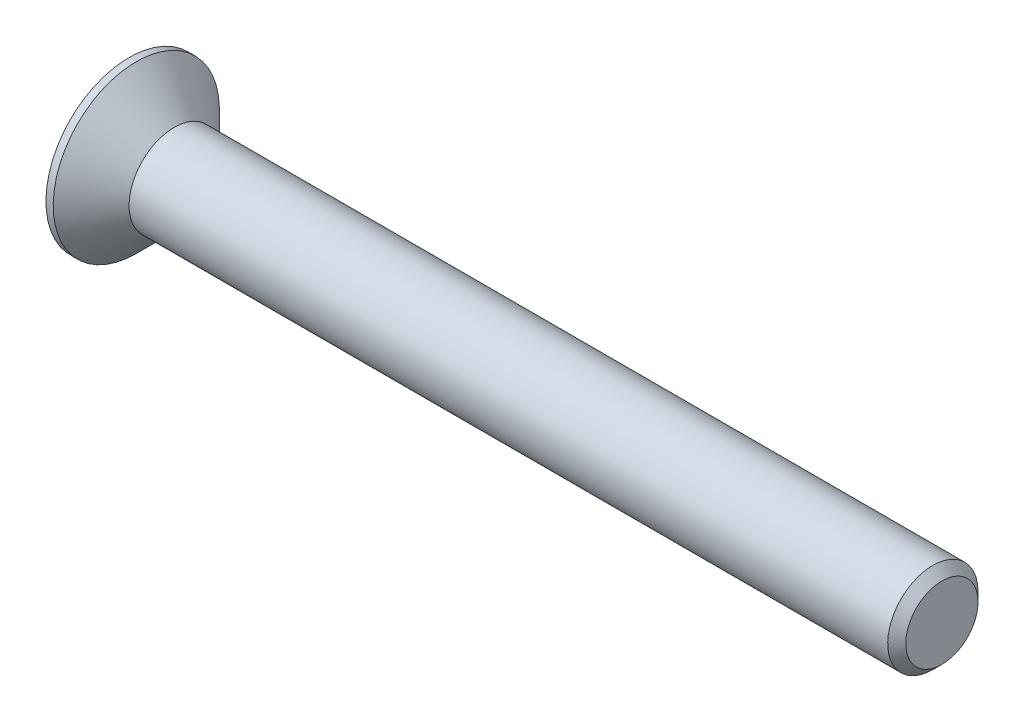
ISO-10303-21;
HEADER;
FILE_DESCRIPTION(('STEP AP214'),'2;1');
FILE_NAME('part.step','',(''),(''),'','','');
FILE_SCHEMA(('AUTOMOTIVE_DESIGN { 1 0 10303 214 1 1 1 1 }'));
ENDSEC;
DATA;
#1=APPLICATION_CONTEXT('core data for automotive mechanical design processes');
#2=APPLICATION_PROTOCOL_DEFINITION('international standard','automotive_design',2000,#1);
#3=PRODUCT_CONTEXT('',#1,'mechanical');
#4=PRODUCT('Part','Part','',(#3));
#5=PRODUCT_RELATED_PRODUCT_CATEGORY('part','',(#4));
#6=PRODUCT_DEFINITION_FORMATION('','',#4);
#7=PRODUCT_DEFINITION_CONTEXT('part definition',#1,'design');
#8=PRODUCT_DEFINITION('design','',#6,#7);
#9=PRODUCT_DEFINITION_SHAPE('','',#8);
#10=(LENGTH_UNIT() NAMED_UNIT(*) SI_UNIT(.MILLI.,.METRE.));
#11=(NAMED_UNIT(*) PLANE_ANGLE_UNIT() SI_UNIT($,.RADIAN.));
#12=(NAMED_UNIT(*) SI_UNIT($,.STERADIAN.) SOLID_ANGLE_UNIT());
#13=UNCERTAINTY_MEASURE_WITH_UNIT(LENGTH_MEASURE(1.E-05),#10,'distance_accuracy_value','');
#14=(GEOMETRIC_REPRESENTATION_CONTEXT(3) GLOBAL_UNCERTAINTY_ASSIGNED_CONTEXT((#13)) GLOBAL_UNIT_ASSIGNED_CONTEXT((#10,
#11,#12)) REPRESENTATION_CONTEXT('',''));
#15=CARTESIAN_POINT('',(0.,0.,0.));
#16=DIRECTION('',(0.,0.,1.));
#17=DIRECTION('',(1.,0.,0.));
#18=AXIS2_PLACEMENT_3D('',#15,#16,#17);
#19=CARTESIAN_POINT('',(0.,0.,0.));
#20=DIRECTION('',(-1.,0.,0.));
#21=DIRECTION('',(0.,-1.,0.));
#22=AXIS2_PLACEMENT_3D('',#19,#20,#21);
#23=CONICAL_SURFACE('',#22,2.5,0.78539816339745);
#24=CARTESIAN_POINT('',(-2.09999999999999,0.,0.));
#25=DIRECTION('',(-1.,0.,0.));
#26=DIRECTION('',(0.,-1.,0.));
#27=AXIS2_PLACEMENT_3D('',#24,#25,#26);
#28=CIRCLE('',#27,4.6);
#29=CARTESIAN_POINT('',(-2.09999999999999,-4.6,0.));
#30=VERTEX_POINT('',#29);
#31=EDGE_CURVE('E189',#30,#30,#28,.T.);
#32=ORIENTED_EDGE('',*,*,#31,.F.);
#33=EDGE_LOOP('',(#32));
#34=FACE_BOUND('',#33,.T.);
#35=CARTESIAN_POINT('',(0.,0.,0.));
#36=DIRECTION('',(-1.,0.,0.));
#37=DIRECTION('',(0.,-1.,0.));
#38=AXIS2_PLACEMENT_3D('',#35,#36,#37);
#39=CIRCLE('',#38,2.5);
#40=CARTESIAN_POINT('',(0.,-2.5,0.));
#41=VERTEX_POINT('',#40);
#42=EDGE_CURVE('E212',#41,#41,#39,.T.);
#43=ORIENTED_EDGE('',*,*,#42,.T.);
#44=EDGE_LOOP('',(#43));
#45=FACE_BOUND('',#44,.T.);
#46=ADVANCED_FACE('F33',(#34,#45),#23,.T.);
#47=CARTESIAN_POINT('',(-2.5,0.,0.));
#48=DIRECTION('',(-1.,0.,0.));
#49=DIRECTION('',(0.,-1.,0.));
#50=AXIS2_PLACEMENT_3D('',#47,#48,#49);
#51=CYLINDRICAL_SURFACE('',#50,2.5);
#52=CARTESIAN_POINT('',(42.,0.,0.));
#53=DIRECTION('',(-1.,0.,0.));
#54=DIRECTION('',(0.,-1.,0.));
#55=AXIS2_PLACEMENT_3D('',#52,#53,#54);
#56=CIRCLE('',#55,2.5);
#57=CARTESIAN_POINT('',(42.,-2.5,0.));
#58=VERTEX_POINT('',#57);
#59=EDGE_CURVE('E41',#58,#58,#56,.T.);
#60=ORIENTED_EDGE('',*,*,#59,.T.);
#61=EDGE_LOOP('',(#60));
#62=FACE_BOUND('',#61,.T.);
#63=ORIENTED_EDGE('',*,*,#42,.F.);
#64=EDGE_LOOP('',(#63));
#65=FACE_BOUND('',#64,.T.);
#66=ADVANCED_FACE('F217',(#62,#65),#51,.T.);
#67=CARTESIAN_POINT('',(42.5,0.,0.));
#68=DIRECTION('',(-1.,0.,0.));
#69=DIRECTION('',(0.,-1.,0.));
#70=AXIS2_PLACEMENT_3D('',#67,#68,#69);
#71=PLANE('',#70);
#72=CARTESIAN_POINT('',(42.5,0.,0.));
#73=DIRECTION('',(-1.,0.,0.));
#74=DIRECTION('',(0.,-1.,0.));
#75=AXIS2_PLACEMENT_3D('',#72,#73,#74);
#76=CIRCLE('',#75,2.00000000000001);
#77=CARTESIAN_POINT('',(42.5,-2.00000000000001,0.));
#78=VERTEX_POINT('',#77);
#79=EDGE_CURVE('E11',#78,#78,#76,.F.);
#80=ORIENTED_EDGE('',*,*,#79,.T.);
#81=EDGE_LOOP('',(#80));
#82=FACE_BOUND('',#81,.T.);
#83=ADVANCED_FACE('F239',(#82),#71,.F.);
#84=CARTESIAN_POINT('',(-2.5,4.6,0.));
#85=DIRECTION('',(1.,0.,0.));
#86=DIRECTION('',(0.,1.,0.));
#87=AXIS2_PLACEMENT_3D('',#84,#85,#86);
#88=PLANE('',#87);
#89=DIRECTION('',(0.,0.,-1.));
#90=VECTOR('',#89,1.);
#91=CARTESIAN_POINT('',(-2.5,0.575,-2.3));
#92=LINE('',#91,#90);
#93=CARTESIAN_POINT('',(-2.5,0.575,-0.575));
#94=VERTEX_POINT('',#93);
#95=CARTESIAN_POINT('',(-2.5,0.575,-2.3));
#96=VERTEX_POINT('',#95);
#97=EDGE_CURVE('E158',#94,#96,#92,.T.);
#98=ORIENTED_EDGE('',*,*,#97,.F.);
#99=DIRECTION('',(0.,-1.,0.));
#100=VECTOR('',#99,1.);
#101=CARTESIAN_POINT('',(-2.5,0.575,-0.575));
#102=LINE('',#101,#100);
#103=CARTESIAN_POINT('',(-2.5,2.3,-0.575));
#104=VERTEX_POINT('',#103);
#105=EDGE_CURVE('E48',#104,#94,#102,.T.);
#106=ORIENTED_EDGE('',*,*,#105,.F.);
#107=DIRECTION('',(0.,0.,-1.));
#108=VECTOR('',#107,1.);
#109=CARTESIAN_POINT('',(-2.5,2.3,-0.575));
#110=LINE('',#109,#108);
#111=CARTESIAN_POINT('',(-2.5,2.3,0.575));
#112=VERTEX_POINT('',#111);
#113=EDGE_CURVE('E185',#112,#104,#110,.T.);
#114=ORIENTED_EDGE('',*,*,#113,.F.);
#115=DIRECTION('',(0.,1.,0.));
#116=VECTOR('',#115,1.);
#117=CARTESIAN_POINT('',(-2.5,2.3,0.575));
#118=LINE('',#117,#116);
#119=CARTESIAN_POINT('',(-2.5,0.575,0.575));
#120=VERTEX_POINT('',#119);
#121=EDGE_CURVE('E183',#120,#112,#118,.T.);
#122=ORIENTED_EDGE('',*,*,#121,.F.);
#123=DIRECTION('',(0.,0.,-1.));
#124=VECTOR('',#123,1.);
#125=CARTESIAN_POINT('',(-2.5,0.575,0.575));
#126=LINE('',#125,#124);
#127=CARTESIAN_POINT('',(-2.5,0.575,2.3));
#128=VERTEX_POINT('',#127);
#129=EDGE_CURVE('E132',#128,#120,#126,.T.);
#130=ORIENTED_EDGE('',*,*,#129,.F.);
#131=DIRECTION('',(0.,1.,0.));
#132=VECTOR('',#131,1.);
#133=CARTESIAN_POINT('',(-2.5,0.575,2.3));
#134=LINE('',#133,#132);
#135=CARTESIAN_POINT('',(-2.5,-0.575,2.3));
#136=VERTEX_POINT('',#135);
#137=EDGE_CURVE('E179',#136,#128,#134,.T.);
#138=ORIENTED_EDGE('',*,*,#137,.F.);
#139=DIRECTION('',(0.,0.,1.));
#140=VECTOR('',#139,1.);
#141=CARTESIAN_POINT('',(-2.5,-0.575,2.3));
#142=LINE('',#141,#140);
#143=CARTESIAN_POINT('',(-2.5,-0.575,0.575));
#144=VERTEX_POINT('',#143);
#145=EDGE_CURVE('E176',#144,#136,#142,.T.);
#146=ORIENTED_EDGE('',*,*,#145,.F.);
#147=DIRECTION('',(0.,1.,0.));
#148=VECTOR('',#147,1.);
#149=CARTESIAN_POINT('',(-2.5,-0.575,0.575));
#150=LINE('',#149,#148);
#151=CARTESIAN_POINT('',(-2.5,-2.3,0.575));
#152=VERTEX_POINT('',#151);
#153=EDGE_CURVE('E173',#152,#144,#150,.T.);
#154=ORIENTED_EDGE('',*,*,#153,.F.);
#155=DIRECTION('',(0.,0.,1.));
#156=VECTOR('',#155,1.);
#157=CARTESIAN_POINT('',(-2.5,-2.3,0.575));
#158=LINE('',#157,#156);
#159=CARTESIAN_POINT('',(-2.5,-2.3,-0.575));
#160=VERTEX_POINT('',#159);
#161=EDGE_CURVE('E170',#160,#152,#158,.T.);
#162=ORIENTED_EDGE('',*,*,#161,.F.);
#163=DIRECTION('',(0.,-1.,0.));
#164=VECTOR('',#163,1.);
#165=CARTESIAN_POINT('',(-2.5,-2.3,-0.575));
#166=LINE('',#165,#164);
#167=CARTESIAN_POINT('',(-2.5,-0.575,-0.575));
#168=VERTEX_POINT('',#167);
#169=EDGE_CURVE('E167',#168,#160,#166,.T.);
#170=ORIENTED_EDGE('',*,*,#169,.F.);
#171=DIRECTION('',(0.,0.,1.));
#172=VECTOR('',#171,1.);
#173=CARTESIAN_POINT('',(-2.5,-0.575,-0.575));
#174=LINE('',#173,#172);
#175=CARTESIAN_POINT('',(-2.5,-0.575,-2.3));
#176=VERTEX_POINT('',#175);
#177=EDGE_CURVE('E164',#176,#168,#174,.T.);
#178=ORIENTED_EDGE('',*,*,#177,.F.);
#179=DIRECTION('',(0.,-1.,0.));
#180=VECTOR('',#179,1.);
#181=CARTESIAN_POINT('',(-2.5,-0.575,-2.3));
#182=LINE('',#181,#180);
#183=EDGE_CURVE('E161',#96,#176,#182,.T.);
#184=ORIENTED_EDGE('',*,*,#183,.F.);
#185=EDGE_LOOP('',(#98,#106,#114,#122,#130,#138,#146,#154,#162,#170,#178,#184));
#186=FACE_BOUND('',#185,.T.);
#187=CARTESIAN_POINT('',(-2.5,0.,0.));
#188=DIRECTION('',(-1.,0.,0.));
#189=DIRECTION('',(0.,-1.,0.));
#190=AXIS2_PLACEMENT_3D('',#187,#188,#189);
#191=CIRCLE('',#190,4.6);
#192=CARTESIAN_POINT('',(-2.5,-4.6,0.));
#193=VERTEX_POINT('',#192);
#194=EDGE_CURVE('E209',#193,#193,#191,.T.);
#195=ORIENTED_EDGE('',*,*,#194,.T.);
#196=EDGE_LOOP('',(#195));
#197=FACE_BOUND('',#196,.T.);
#198=ADVANCED_FACE('F230',(#186,#197),#88,.F.);
#199=CARTESIAN_POINT('',(-2.5,0.,0.));
#200=DIRECTION('',(-1.,0.,0.));
#201=DIRECTION('',(0.,-1.,0.));
#202=AXIS2_PLACEMENT_3D('',#199,#200,#201);
#203=CYLINDRICAL_SURFACE('',#202,4.6);
#204=ORIENTED_EDGE('',*,*,#194,.F.);
#205=EDGE_LOOP('',(#204));
#206=FACE_BOUND('',#205,.T.);
#207=ORIENTED_EDGE('',*,*,#31,.T.);
#208=EDGE_LOOP('',(#207));
#209=FACE_BOUND('',#208,.T.);
#210=ADVANCED_FACE('F222',(#206,#209),#203,.T.);
#211=CARTESIAN_POINT('',(42.,0.,0.));
#212=DIRECTION('',(-1.,0.,0.));
#213=DIRECTION('',(0.,-1.,0.));
#214=AXIS2_PLACEMENT_3D('',#211,#212,#213);
#215=CONICAL_SURFACE('',#214,2.5,0.785398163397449);
#216=ORIENTED_EDGE('',*,*,#79,.F.);
#217=EDGE_LOOP('',(#216));
#218=FACE_BOUND('',#217,.T.);
#219=ORIENTED_EDGE('',*,*,#59,.F.);
#220=EDGE_LOOP('',(#219));
#221=FACE_BOUND('',#220,.T.);
#222=ADVANCED_FACE('F35',(#218,#221),#215,.T.);
#223=CARTESIAN_POINT('',(-0.4,0.575,-0.575));
#224=DIRECTION('',(0.,0.,-1.));
#225=DIRECTION('',(-1.,0.,0.));
#226=AXIS2_PLACEMENT_3D('',#223,#224,#225);
#227=PLANE('',#226);
#228=ORIENTED_EDGE('',*,*,#105,.T.);
#229=DIRECTION('',(-1.,0.,0.));
#230=VECTOR('',#229,1.);
#231=CARTESIAN_POINT('',(-0.4,0.575,-0.575));
#232=LINE('',#231,#230);
#233=CARTESIAN_POINT('',(-0.4,0.575,-0.575));
#234=VERTEX_POINT('',#233);
#235=EDGE_CURVE('E96',#234,#94,#232,.T.);
#236=ORIENTED_EDGE('',*,*,#235,.F.);
#237=DIRECTION('',(0.,-1.,0.));
#238=VECTOR('',#237,1.);
#239=CARTESIAN_POINT('',(-0.4,0.575,-0.575));
#240=LINE('',#239,#238);
#241=CARTESIAN_POINT('',(-0.4,2.3,-0.575));
#242=VERTEX_POINT('',#241);
#243=EDGE_CURVE('E187',#242,#234,#240,.T.);
#244=ORIENTED_EDGE('',*,*,#243,.F.);
#245=DIRECTION('',(-1.,0.,0.));
#246=VECTOR('',#245,1.);
#247=CARTESIAN_POINT('',(-0.4,2.3,-0.575));
#248=LINE('',#247,#246);
#249=EDGE_CURVE('E56',#242,#104,#248,.T.);
#250=ORIENTED_EDGE('',*,*,#249,.T.);
#251=EDGE_LOOP('',(#228,#236,#244,#250));
#252=FACE_BOUND('',#251,.T.);
#253=ADVANCED_FACE('F221',(#252),#227,.F.);
#254=CARTESIAN_POINT('',(-0.4,2.3,-0.575));
#255=DIRECTION('',(0.,1.,0.));
#256=DIRECTION('',(-1.,0.,0.));
#257=AXIS2_PLACEMENT_3D('',#254,#255,#256);
#258=PLANE('',#257);
#259=ORIENTED_EDGE('',*,*,#113,.T.);
#260=ORIENTED_EDGE('',*,*,#249,.F.);
#261=DIRECTION('',(0.,0.,-1.));
#262=VECTOR('',#261,1.);
#263=CARTESIAN_POINT('',(-0.4,2.3,-0.575));
#264=LINE('',#263,#262);
#265=CARTESIAN_POINT('',(-0.4,2.3,0.575));
#266=VERTEX_POINT('',#265);
#267=EDGE_CURVE('E144',#266,#242,#264,.T.);
#268=ORIENTED_EDGE('',*,*,#267,.F.);
#269=DIRECTION('',(-1.,0.,0.));
#270=VECTOR('',#269,1.);
#271=CARTESIAN_POINT('',(-0.4,2.3,0.575));
#272=LINE('',#271,#270);
#273=EDGE_CURVE('E136',#266,#112,#272,.T.);
#274=ORIENTED_EDGE('',*,*,#273,.T.);
#275=EDGE_LOOP('',(#259,#260,#268,#274));
#276=FACE_BOUND('',#275,.T.);
#277=ADVANCED_FACE('F228',(#276),#258,.F.);
#278=CARTESIAN_POINT('',(-0.4,2.3,0.575));
#279=DIRECTION('',(0.,0.,1.));
#280=DIRECTION('',(1.,0.,0.));
#281=AXIS2_PLACEMENT_3D('',#278,#279,#280);
#282=PLANE('',#281);
#283=ORIENTED_EDGE('',*,*,#121,.T.);
#284=ORIENTED_EDGE('',*,*,#273,.F.);
#285=DIRECTION('',(0.,1.,0.));
#286=VECTOR('',#285,1.);
#287=CARTESIAN_POINT('',(-0.4,2.3,0.575));
#288=LINE('',#287,#286);
#289=CARTESIAN_POINT('',(-0.4,0.575,0.575));
#290=VERTEX_POINT('',#289);
#291=EDGE_CURVE('E140',#290,#266,#288,.T.);
#292=ORIENTED_EDGE('',*,*,#291,.F.);
#293=DIRECTION('',(-1.,0.,0.));
#294=VECTOR('',#293,1.);
#295=CARTESIAN_POINT('',(-0.4,0.575,0.575));
#296=LINE('',#295,#294);
#297=EDGE_CURVE('E125',#290,#120,#296,.T.);
#298=ORIENTED_EDGE('',*,*,#297,.T.);
#299=EDGE_LOOP('',(#283,#284,#292,#298));
#300=FACE_BOUND('',#299,.T.);
#301=ADVANCED_FACE('F141',(#300),#282,.F.);
#302=CARTESIAN_POINT('',(-0.4,0.575,0.575));
#303=DIRECTION('',(0.,1.,0.));
#304=DIRECTION('',(-1.,0.,0.));
#305=AXIS2_PLACEMENT_3D('',#302,#303,#304);
#306=PLANE('',#305);
#307=ORIENTED_EDGE('',*,*,#129,.T.);
#308=ORIENTED_EDGE('',*,*,#297,.F.);
#309=DIRECTION('',(0.,0.,-1.));
#310=VECTOR('',#309,1.);
#311=CARTESIAN_POINT('',(-0.4,0.575,0.575));
#312=LINE('',#311,#310);
#313=CARTESIAN_POINT('',(-0.4,0.575,2.3));
#314=VERTEX_POINT('',#313);
#315=EDGE_CURVE('E129',#314,#290,#312,.T.);
#316=ORIENTED_EDGE('',*,*,#315,.F.);
#317=DIRECTION('',(-1.,0.,0.));
#318=VECTOR('',#317,1.);
#319=CARTESIAN_POINT('',(-0.4,0.575,2.3));
#320=LINE('',#319,#318);
#321=EDGE_CURVE('E137',#314,#128,#320,.T.);
#322=ORIENTED_EDGE('',*,*,#321,.T.);
#323=EDGE_LOOP('',(#307,#308,#316,#322));
#324=FACE_BOUND('',#323,.T.);
#325=ADVANCED_FACE('F127',(#324),#306,.F.);
#326=CARTESIAN_POINT('',(-0.4,0.575,2.3));
#327=DIRECTION('',(0.,0.,1.));
#328=DIRECTION('',(1.,0.,0.));
#329=AXIS2_PLACEMENT_3D('',#326,#327,#328);
#330=PLANE('',#329);
#331=ORIENTED_EDGE('',*,*,#137,.T.);
#332=ORIENTED_EDGE('',*,*,#321,.F.);
#333=DIRECTION('',(0.,1.,0.));
#334=VECTOR('',#333,1.);
#335=CARTESIAN_POINT('',(-0.4,0.575,2.3));
#336=LINE('',#335,#334);
#337=CARTESIAN_POINT('',(-0.4,-0.575,2.3));
#338=VERTEX_POINT('',#337);
#339=EDGE_CURVE('E150',#338,#314,#336,.T.);
#340=ORIENTED_EDGE('',*,*,#339,.F.);
#341=DIRECTION('',(-1.,0.,0.));
#342=VECTOR('',#341,1.);
#343=CARTESIAN_POINT('',(-0.4,-0.575,2.3));
#344=LINE('',#343,#342);
#345=EDGE_CURVE('E192',#338,#136,#344,.T.);
#346=ORIENTED_EDGE('',*,*,#345,.T.);
#347=EDGE_LOOP('',(#331,#332,#340,#346));
#348=FACE_BOUND('',#347,.T.);
#349=ADVANCED_FACE('F277',(#348),#330,.F.);
#350=CARTESIAN_POINT('',(-0.4,-0.575,2.3));
#351=DIRECTION('',(0.,-1.,0.));
#352=DIRECTION('',(1.,0.,0.));
#353=AXIS2_PLACEMENT_3D('',#350,#351,#352);
#354=PLANE('',#353);
#355=ORIENTED_EDGE('',*,*,#145,.T.);
#356=ORIENTED_EDGE('',*,*,#345,.F.);
#357=DIRECTION('',(0.,0.,1.));
#358=VECTOR('',#357,1.);
#359=CARTESIAN_POINT('',(-0.4,-0.575,2.3));
#360=LINE('',#359,#358);
#361=CARTESIAN_POINT('',(-0.4,-0.575,0.575));
#362=VERTEX_POINT('',#361);
#363=EDGE_CURVE('E152',#362,#338,#360,.T.);
#364=ORIENTED_EDGE('',*,*,#363,.F.);
#365=DIRECTION('',(-1.,0.,0.));
#366=VECTOR('',#365,1.);
#367=CARTESIAN_POINT('',(-0.4,-0.575,0.575));
#368=LINE('',#367,#366);
#369=EDGE_CURVE('E194',#362,#144,#368,.T.);
#370=ORIENTED_EDGE('',*,*,#369,.T.);
#371=EDGE_LOOP('',(#355,#356,#364,#370));
#372=FACE_BOUND('',#371,.T.);
#373=ADVANCED_FACE('F273',(#372),#354,.F.);
#374=CARTESIAN_POINT('',(-0.4,-0.575,0.575));
#375=DIRECTION('',(0.,0.,1.));
#376=DIRECTION('',(1.,0.,0.));
#377=AXIS2_PLACEMENT_3D('',#374,#375,#376);
#378=PLANE('',#377);
#379=ORIENTED_EDGE('',*,*,#153,.T.);
#380=ORIENTED_EDGE('',*,*,#369,.F.);
#381=DIRECTION('',(0.,1.,0.));
#382=VECTOR('',#381,1.);
#383=CARTESIAN_POINT('',(-0.4,-0.575,0.575));
#384=LINE('',#383,#382);
#385=CARTESIAN_POINT('',(-0.4,-2.3,0.575));
#386=VERTEX_POINT('',#385);
#387=EDGE_CURVE('E422',#386,#362,#384,.T.);
#388=ORIENTED_EDGE('',*,*,#387,.F.);
#389=DIRECTION('',(-1.,0.,0.));
#390=VECTOR('',#389,1.);
#391=CARTESIAN_POINT('',(-0.4,-2.3,0.575));
#392=LINE('',#391,#390);
#393=EDGE_CURVE('E196',#386,#152,#392,.T.);
#394=ORIENTED_EDGE('',*,*,#393,.T.);
#395=EDGE_LOOP('',(#379,#380,#388,#394));
#396=FACE_BOUND('',#395,.T.);
#397=ADVANCED_FACE('F269',(#396),#378,.F.);
#398=CARTESIAN_POINT('',(-0.4,-2.3,0.575));
#399=DIRECTION('',(0.,-1.,0.));
#400=DIRECTION('',(1.,0.,0.));
#401=AXIS2_PLACEMENT_3D('',#398,#399,#400);
#402=PLANE('',#401);
#403=ORIENTED_EDGE('',*,*,#161,.T.);
#404=ORIENTED_EDGE('',*,*,#393,.F.);
#405=DIRECTION('',(0.,0.,1.));
#406=VECTOR('',#405,1.);
#407=CARTESIAN_POINT('',(-0.4,-2.3,0.575));
#408=LINE('',#407,#406);
#409=CARTESIAN_POINT('',(-0.4,-2.3,-0.575));
#410=VERTEX_POINT('',#409);
#411=EDGE_CURVE('E419',#410,#386,#408,.T.);
#412=ORIENTED_EDGE('',*,*,#411,.F.);
#413=DIRECTION('',(-1.,0.,0.));
#414=VECTOR('',#413,1.);
#415=CARTESIAN_POINT('',(-0.4,-2.3,-0.575));
#416=LINE('',#415,#414);
#417=EDGE_CURVE('E198',#410,#160,#416,.T.);
#418=ORIENTED_EDGE('',*,*,#417,.T.);
#419=EDGE_LOOP('',(#403,#404,#412,#418));
#420=FACE_BOUND('',#419,.T.);
#421=ADVANCED_FACE('F265',(#420),#402,.F.);
#422=CARTESIAN_POINT('',(-0.4,-2.3,-0.575));
#423=DIRECTION('',(0.,0.,-1.));
#424=DIRECTION('',(-1.,0.,0.));
#425=AXIS2_PLACEMENT_3D('',#422,#423,#424);
#426=PLANE('',#425);
#427=ORIENTED_EDGE('',*,*,#169,.T.);
#428=ORIENTED_EDGE('',*,*,#417,.F.);
#429=DIRECTION('',(0.,-1.,0.));
#430=VECTOR('',#429,1.);
#431=CARTESIAN_POINT('',(-0.4,-2.3,-0.575));
#432=LINE('',#431,#430);
#433=CARTESIAN_POINT('',(-0.4,-0.575,-0.575));
#434=VERTEX_POINT('',#433);
#435=EDGE_CURVE('E416',#434,#410,#432,.T.);
#436=ORIENTED_EDGE('',*,*,#435,.F.);
#437=DIRECTION('',(-1.,0.,0.));
#438=VECTOR('',#437,1.);
#439=CARTESIAN_POINT('',(-0.4,-0.575,-0.575));
#440=LINE('',#439,#438);
#441=EDGE_CURVE('E200',#434,#168,#440,.T.);
#442=ORIENTED_EDGE('',*,*,#441,.T.);
#443=EDGE_LOOP('',(#427,#428,#436,#442));
#444=FACE_BOUND('',#443,.T.);
#445=ADVANCED_FACE('F261',(#444),#426,.F.);
#446=CARTESIAN_POINT('',(-0.4,-0.575,-0.575));
#447=DIRECTION('',(0.,-1.,0.));
#448=DIRECTION('',(1.,0.,0.));
#449=AXIS2_PLACEMENT_3D('',#446,#447,#448);
#450=PLANE('',#449);
#451=ORIENTED_EDGE('',*,*,#177,.T.);
#452=ORIENTED_EDGE('',*,*,#441,.F.);
#453=DIRECTION('',(0.,0.,1.));
#454=VECTOR('',#453,1.);
#455=CARTESIAN_POINT('',(-0.4,-0.575,-0.575));
#456=LINE('',#455,#454);
#457=CARTESIAN_POINT('',(-0.4,-0.575,-2.3));
#458=VERTEX_POINT('',#457);
#459=EDGE_CURVE('E413',#458,#434,#456,.T.);
#460=ORIENTED_EDGE('',*,*,#459,.F.);
#461=DIRECTION('',(-1.,0.,0.));
#462=VECTOR('',#461,1.);
#463=CARTESIAN_POINT('',(-0.4,-0.575,-2.3));
#464=LINE('',#463,#462);
#465=EDGE_CURVE('E202',#458,#176,#464,.T.);
#466=ORIENTED_EDGE('',*,*,#465,.T.);
#467=EDGE_LOOP('',(#451,#452,#460,#466));
#468=FACE_BOUND('',#467,.T.);
#469=ADVANCED_FACE('F257',(#468),#450,.F.);
#470=CARTESIAN_POINT('',(-0.4,-0.575,-2.3));
#471=DIRECTION('',(0.,0.,-1.));
#472=DIRECTION('',(-1.,0.,0.));
#473=AXIS2_PLACEMENT_3D('',#470,#471,#472);
#474=PLANE('',#473);
#475=ORIENTED_EDGE('',*,*,#183,.T.);
#476=ORIENTED_EDGE('',*,*,#465,.F.);
#477=DIRECTION('',(0.,-1.,0.));
#478=VECTOR('',#477,1.);
#479=CARTESIAN_POINT('',(-0.4,-0.575,-2.3));
#480=LINE('',#479,#478);
#481=CARTESIAN_POINT('',(-0.4,0.575,-2.3));
#482=VERTEX_POINT('',#481);
#483=EDGE_CURVE('E408',#482,#458,#480,.T.);
#484=ORIENTED_EDGE('',*,*,#483,.F.);
#485=DIRECTION('',(-1.,0.,0.));
#486=VECTOR('',#485,1.);
#487=CARTESIAN_POINT('',(-0.4,0.575,-2.3));
#488=LINE('',#487,#486);
#489=EDGE_CURVE('E204',#482,#96,#488,.T.);
#490=ORIENTED_EDGE('',*,*,#489,.T.);
#491=EDGE_LOOP('',(#475,#476,#484,#490));
#492=FACE_BOUND('',#491,.T.);
#493=ADVANCED_FACE('F253',(#492),#474,.F.);
#494=CARTESIAN_POINT('',(-0.4,0.575,-2.3));
#495=DIRECTION('',(0.,1.,0.));
#496=DIRECTION('',(-1.,0.,0.));
#497=AXIS2_PLACEMENT_3D('',#494,#495,#496);
#498=PLANE('',#497);
#499=ORIENTED_EDGE('',*,*,#97,.T.);
#500=ORIENTED_EDGE('',*,*,#489,.F.);
#501=DIRECTION('',(0.,0.,-1.));
#502=VECTOR('',#501,1.);
#503=CARTESIAN_POINT('',(-0.4,0.575,-2.3));
#504=LINE('',#503,#502);
#505=EDGE_CURVE('E406',#234,#482,#504,.T.);
#506=ORIENTED_EDGE('',*,*,#505,.F.);
#507=ORIENTED_EDGE('',*,*,#235,.T.);
#508=EDGE_LOOP('',(#499,#500,#506,#507));
#509=FACE_BOUND('',#508,.T.);
#510=ADVANCED_FACE('F250',(#509),#498,.F.);
#511=CARTESIAN_POINT('',(-0.4,0.,0.));
#512=DIRECTION('',(1.,0.,0.));
#513=DIRECTION('',(0.,0.,-1.));
#514=AXIS2_PLACEMENT_3D('',#511,#512,#513);
#515=PLANE('',#514);
#516=ORIENTED_EDGE('',*,*,#243,.T.);
#517=ORIENTED_EDGE('',*,*,#505,.T.);
#518=ORIENTED_EDGE('',*,*,#483,.T.);
#519=ORIENTED_EDGE('',*,*,#459,.T.);
#520=ORIENTED_EDGE('',*,*,#435,.T.);
#521=ORIENTED_EDGE('',*,*,#411,.T.);
#522=ORIENTED_EDGE('',*,*,#387,.T.);
#523=ORIENTED_EDGE('',*,*,#363,.T.);
#524=ORIENTED_EDGE('',*,*,#339,.T.);
#525=ORIENTED_EDGE('',*,*,#315,.T.);
#526=ORIENTED_EDGE('',*,*,#291,.T.);
#527=ORIENTED_EDGE('',*,*,#267,.T.);
#528=EDGE_LOOP('',(#516,#517,#518,#519,#520,#521,#522,#523,#524,#525,#526,#527));
#529=FACE_BOUND('',#528,.T.);
#530=ADVANCED_FACE('F147',(#529),#515,.F.);
#531=CLOSED_SHELL('',(#46,#66,#83,#198,#210,#222,#253,#277,#301,#325,#349,#373,#397,#421,#445,
#469,#493,#510,#530));
#532=MANIFOLD_SOLID_BREP('B2',#531);
#533=ADVANCED_BREP_SHAPE_REPRESENTATION('',(#18,#532),#14);
#534=SHAPE_DEFINITION_REPRESENTATION(#9,#533);
ENDSEC;
END-ISO-10303-21;
